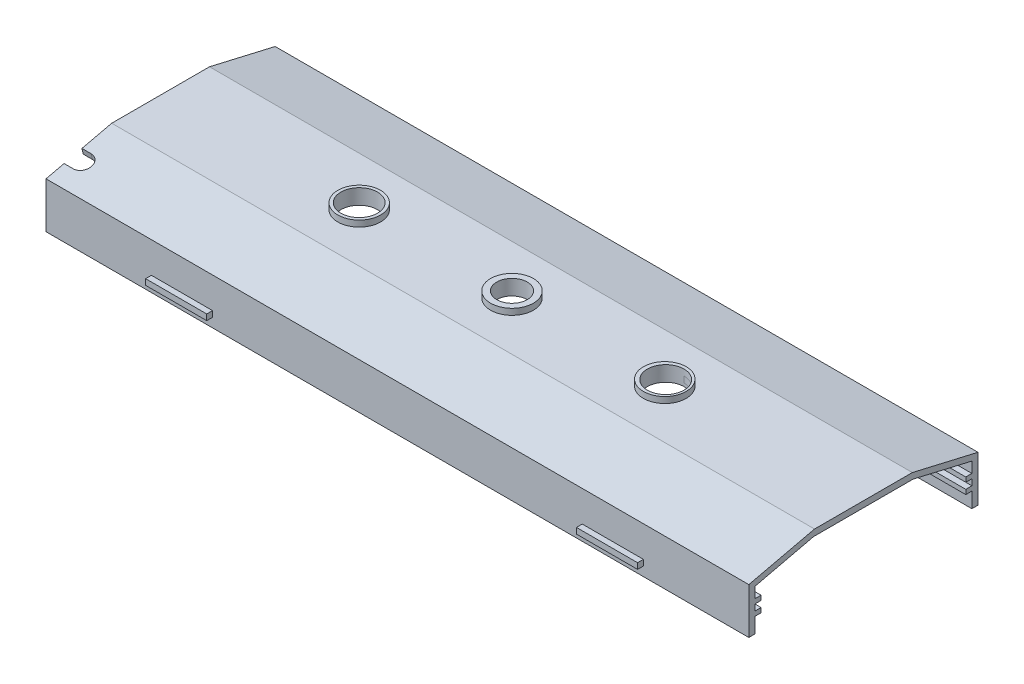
from build123d import *

# Parameters (mm, degrees)
EXTRUSION1_DEPTH             = 230
ESQUISSE2_R                  = 7
EXTRUSION2_DEPTH             = 2
ESQUISSE3_R                  = 6
ENL_V_MAT_EXTRU_1_DEPTH      = 234.893672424
ESQUISSE4_R                  = 8
EXTRUSION3_DEPTH             = 1
ESQUISSE5_R                  = 6
ENL_V_MAT_EXTRU_2_DEPTH      = 235.07317232
ESQUISSE6_R                  = 7
EXTRUSION4_DEPTH             = 2
ESQUISSE7_R                  = 8
EXTRUSION5_DEPTH             = 1
ESQUISSE8_R                  = 6
ENL_V_MAT_EXTRU_3_DEPTH      = 234.656264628
ESQUISSE9_R                  = 7
EXTRUSION6_DEPTH             = 2
ESQUISSE10_R                 = 8
EXTRUSION7_DEPTH             = 1
ESQUISSE11_R                 = 5
ENL_V_MAT_EXTRU_4_DEPTH      = 234.656264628
ENL_V_MAT_EXTRU_5_DEPTH      = 236.016108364
ENL_V_MAT_EXTRU_5_DEPTH_BACK = 236.016108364
ESQUISSE13_W                 = 20
ESQUISSE13_H                 = 1.9
EXTRUSION8_DEPTH             = 1.9
ESQUISSE14_W                 = 20
ESQUISSE14_H                 = 1.9
EXTRUSION9_DEPTH             = 1.9
ESQUISSE15_W                 = 20
ESQUISSE15_H                 = 1.9
EXTRUSION10_DEPTH            = 1.9
ESQUISSE16_W                 = 20
ESQUISSE16_H                 = 1.9
EXTRUSION11_DEPTH            = 1.9


with BuildPart() as part:
    # Esquisse1 → Extrusion1 (new body)
    with BuildSketch(Plane(origin=(0, 0, 0), x_dir=(0, 0, -1), z_dir=(1, 0, 0))):
        Polygon((16, 20), (-16, 20), (-37.5, 15), (-37.5, 0), (-35.5, 0), (-35.5, 5), (-33.5, 5), (-33.5, 6.5), (-35.5, 6.5), (-35.5, 8.5), (-33.5, 8.5), (-33.5, 10), (-35.5, 10), (-35.5, 13.5), (-16.3, 18), (16.3, 18), (35.5, 13.5), (35.5, 10), (33.5, 10), (33.5, 8.5), (35.5, 8.5), (35.5, 6.5), (33.5, 6.5), (33.5, 5), (35.5, 5), (35.5, 0), (37.5, 0), (37.5, 15), align=None)
    extrude(amount=EXTRUSION1_DEPTH)

    # Esquisse2 → Extrusion2 (add)
    with BuildSketch(Plane(origin=(0, 20, 0), x_dir=(-1, 0, 0), z_dir=(0, 1, 0))):
        with Locations(Location((-165, 0, 0), (0, 0, 270))):
            Circle(ESQUISSE2_R)
    extrude(amount=EXTRUSION2_DEPTH)

    # Esquisse3 → Enl_v. mat.-Extru.1 (cut, through all)
    with BuildSketch(Plane(origin=(0, 20, 0), x_dir=(-1, 0, 0), z_dir=(0, 1, 0))):
        with Locations(Location((-165.326797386, 0, 0), (0, 0, 90))):
            Circle(ESQUISSE3_R)
    extrude(amount=-ENL_V_MAT_EXTRU_1_DEPTH, mode=Mode.SUBTRACT)

    # Esquisse4 → Extrusion3 (add)
    with BuildSketch(Plane.XZ.offset(-18)):
        with Locations(Location((165.907368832, 0, 0), (0, 0, 90))):
            Circle(ESQUISSE4_R)
    extrude(amount=EXTRUSION3_DEPTH)

    # Esquisse5 → Enl_v. mat.-Extru.2 (cut, through all)
    with BuildSketch(Plane(origin=(0, 22, 0), x_dir=(-1, 0, 0), z_dir=(0, 1, 0))):
        with Locations(Location((-165.302253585, 0, 0), (0, 0, 90))):
            Circle(ESQUISSE5_R)
    extrude(amount=-ENL_V_MAT_EXTRU_2_DEPTH, mode=Mode.SUBTRACT)

    # Esquisse6 → Extrusion4 (add)
    with BuildSketch(Plane(origin=(0, 20, 0), x_dir=(-1, 0, 0), z_dir=(0, 1, 0))):
        with Locations(Location((-65, 0, 0), (0, 0, 270))):
            Circle(ESQUISSE6_R)
    extrude(amount=EXTRUSION4_DEPTH)

    # Esquisse7 → Extrusion5 (add)
    with BuildSketch(Plane.XZ.offset(-18)):
        with Locations(Location((65, 0, 0), (0, 0, 90))):
            Circle(ESQUISSE7_R)
    extrude(amount=EXTRUSION5_DEPTH)

    # Esquisse8 → Enl_v. mat.-Extru.3 (cut, through all)
    with BuildSketch(Plane.XZ.offset(-17)):
        with Locations(Location((65, 0, 0), (0, 0, 270))):
            Circle(ESQUISSE8_R)
    extrude(amount=-ENL_V_MAT_EXTRU_3_DEPTH, mode=Mode.SUBTRACT)

    # Esquisse9 → Extrusion6 (add)
    with BuildSketch(Plane(origin=(0, 20, 0), x_dir=(-1, 0, 0), z_dir=(0, 1, 0))):
        with Locations(Location((-115, 0, 0), (0, 0, 270))):
            Circle(ESQUISSE9_R)
    extrude(amount=EXTRUSION6_DEPTH)

    # Esquisse10 → Extrusion7 (add)
    with BuildSketch(Plane.XZ.offset(-18)):
        with Locations(Location((115, 0, 0), (0, 0, 90))):
            Circle(ESQUISSE10_R)
    extrude(amount=EXTRUSION7_DEPTH)

    # Esquisse11 → Enl_v. mat.-Extru.4 (cut, through all)
    with BuildSketch(Plane.XZ.offset(-17)):
        with Locations(Location((115, 0, 0), (0, 0, 270))):
            Circle(ESQUISSE11_R)
    extrude(amount=-ENL_V_MAT_EXTRU_4_DEPTH, mode=Mode.SUBTRACT)

    # Esquisse12 → Enl_v. mat.-Extru.5 (cut, two sides: drawn at the far end of the back side and taken through both)
    with BuildSketch(Plane(origin=(0, 22.503848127, 5.233453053), x_dir=(-1, 0, 0), z_dir=(0, 0.9740080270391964, 0.22651349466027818)).offset(-ENL_V_MAT_EXTRU_5_DEPTH_BACK)):
        with BuildLine():
            Line((-3, 21.053858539), (0, 21.053858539))
            Line((0, 21.053858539), (0, 27.053858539))
            Line((0, 27.053858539), (-3, 27.053858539))
            ThreePointArc((-3, 27.053858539), (-6, 24.053858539), (-3, 21.053858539))
        make_face()
    extrude(amount=ENL_V_MAT_EXTRU_5_DEPTH + ENL_V_MAT_EXTRU_5_DEPTH_BACK, mode=Mode.SUBTRACT)

    # Esquisse13 → Extrusion8 (add)
    with BuildSketch(Plane.XY.offset(37.5)):
        with Locations((44.5, 3.95)):
            Rectangle(ESQUISSE13_W, ESQUISSE13_H)
    extrude(amount=EXTRUSION8_DEPTH)

    # Esquisse14 → Extrusion9 (add)
    with BuildSketch(Plane.XY.offset(37.5)):
        with Locations((185.5, 3.95)):
            Rectangle(ESQUISSE14_W, ESQUISSE14_H)
    extrude(amount=EXTRUSION9_DEPTH)

    # Esquisse15 → Extrusion10 (add)
    with BuildSketch(Plane(origin=(0, 0, -37.5), x_dir=(-1, 0, 0), z_dir=(0, 0, -1))):
        with Locations((-185.5, 3.95)):
            Rectangle(ESQUISSE15_W, ESQUISSE15_H)
    extrude(amount=EXTRUSION10_DEPTH)

    # Esquisse16 → Extrusion11 (add)
    with BuildSketch(Plane(origin=(0, 0, -37.5), x_dir=(-1, 0, 0), z_dir=(0, 0, -1))):
        with Locations((-44.5, 3.95)):
            Rectangle(ESQUISSE16_W, ESQUISSE16_H)
    extrude(amount=EXTRUSION11_DEPTH)


solid = part.part
